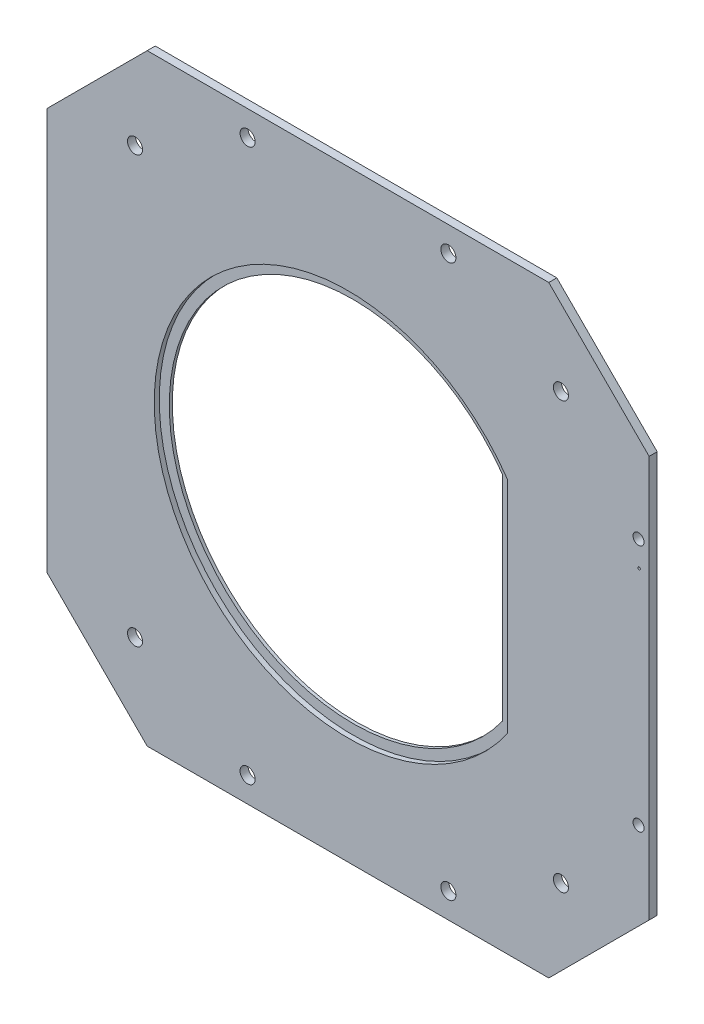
from build123d import *

# Parameters (mm, degrees)
EXTRUDE1_DEPTH               = 1.6
CUT_EXTRUDE1_DEPTH           = 85.867897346
CUT_EXTRUDE2_DEPTH           = 1
F_3_0_3_DIAMETER_HOLE1_D     = 3
F_3_0_3_DIAMETER_HOLE1_DEPTH = 44.45
F_3_0_3_DIAMETER_HOLE1_TIP   = 0.901290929
SKETCH6_R                    = 0.25
CUT_EXTRUDE3_DEPTH           = 85.867897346
F_2_2_2_2_DIAMETER_HOLE1_D   = 2.2


with BuildPart() as part:
    # Sketch1 → Extrude1 (new body)
    with BuildSketch(Plane.XY):
        Polygon((-60, -40), (-40, -60), (40, -60), (60, -40), (60, 40), (40, 60), (-40, 60), (-60, 40), align=None)
    extrude(amount=EXTRUDE1_DEPTH)

    # Sketch2 → Cut-Extrude1 (cut, through all)
    with BuildSketch(Plane.XY.offset(1.6)):
        with BuildLine():
            Line((29.75, 21.318946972), (29.75, -21.318946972))
            ThreePointArc((29.75, -21.318946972), (-36.6, 0), (29.75, 21.318946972))
        make_face()
    extrude(amount=-CUT_EXTRUDE1_DEPTH, mode=Mode.SUBTRACT)

    # Sketch3 → Cut-Extrude2 (cut)
    with BuildSketch(Plane.XY.offset(1.6)):
        with BuildLine():
            Line((31.75, 21.952163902), (31.75, -21.952163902))
            ThreePointArc((31.75, -21.952163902), (-38.6, 0), (31.75, 21.952163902))
        make_face()
    extrude(amount=-CUT_EXTRUDE2_DEPTH, mode=Mode.SUBTRACT)

    # 3.0 _3_ Diameter Hole1
    with Locations(Plane.XY.offset(1.6)):
        with Locations((-42.426406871, 42.426406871), (-20, 55), (20, 55), (42.426406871, 42.426406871), (42.426406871, -42.426406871), (20, -55), (-20, -55), (-42.426406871, -42.426406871)):
            Hole(F_3_0_3_DIAMETER_HOLE1_D / 2, depth=F_3_0_3_DIAMETER_HOLE1_DEPTH)
            with Locations((0, 0, -(F_3_0_3_DIAMETER_HOLE1_DEPTH + F_3_0_3_DIAMETER_HOLE1_TIP / 2))):  # 118° drill point
                Cone(0, F_3_0_3_DIAMETER_HOLE1_D / 2, F_3_0_3_DIAMETER_HOLE1_TIP, mode=Mode.SUBTRACT)

    # Sketch6 → Cut-Extrude3 (cut, through all)
    with BuildSketch(Plane.XY.offset(1.6)):
        with Locations((58, 19.685)):
            Circle(SKETCH6_R)
    extrude(amount=-CUT_EXTRUDE3_DEPTH, mode=Mode.SUBTRACT)

    # 2.2 _2.2_ Diameter Hole1 (through all)
    with Locations(Plane.XY.offset(1.6)):
        with Locations((57.89, -24.685), (57.89, 24.685)):
            Hole(F_2_2_2_2_DIAMETER_HOLE1_D / 2)


solid = part.part
